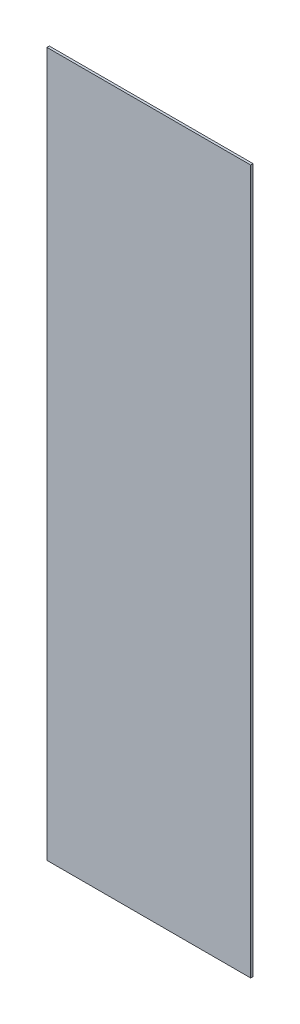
from build123d import *

# Parameters (mm, degrees)
CROQUIS1_W              = 340
CROQUIS1_H              = 1175
SALIENTE_EXTRUIR1_DEPTH = 4


with BuildPart() as part:
    # Croquis1 → Saliente-Extruir1 (new body)
    with BuildSketch(Plane.XY):
        with Locations((170, 587.5)):
            Rectangle(CROQUIS1_W, CROQUIS1_H)
    extrude(amount=SALIENTE_EXTRUIR1_DEPTH)


solid = part.part
